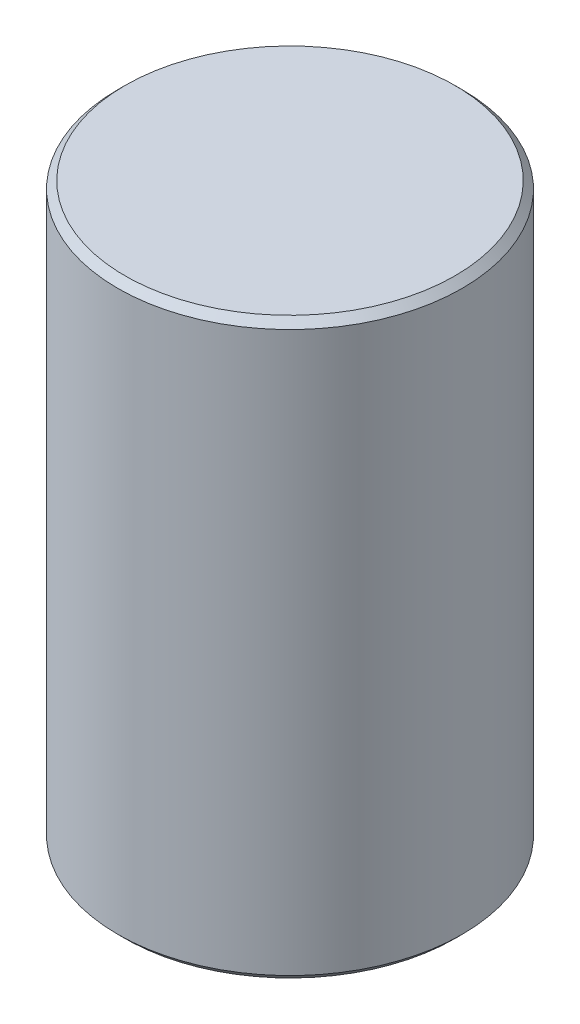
ISO-10303-21;
HEADER;
FILE_DESCRIPTION(('STEP AP214'),'2;1');
FILE_NAME('part.step','',(''),(''),'','','');
FILE_SCHEMA(('AUTOMOTIVE_DESIGN { 1 0 10303 214 1 1 1 1 }'));
ENDSEC;
DATA;
#1=APPLICATION_CONTEXT('core data for automotive mechanical design processes');
#2=APPLICATION_PROTOCOL_DEFINITION('international standard','automotive_design',2000,#1);
#3=PRODUCT_CONTEXT('',#1,'mechanical');
#4=PRODUCT('Part','Part','',(#3));
#5=PRODUCT_RELATED_PRODUCT_CATEGORY('part','',(#4));
#6=PRODUCT_DEFINITION_FORMATION('','',#4);
#7=PRODUCT_DEFINITION_CONTEXT('part definition',#1,'design');
#8=PRODUCT_DEFINITION('design','',#6,#7);
#9=PRODUCT_DEFINITION_SHAPE('','',#8);
#10=(LENGTH_UNIT() NAMED_UNIT(*) SI_UNIT(.MILLI.,.METRE.));
#11=(NAMED_UNIT(*) PLANE_ANGLE_UNIT() SI_UNIT($,.RADIAN.));
#12=(NAMED_UNIT(*) SI_UNIT($,.STERADIAN.) SOLID_ANGLE_UNIT());
#13=UNCERTAINTY_MEASURE_WITH_UNIT(LENGTH_MEASURE(1.E-05),#10,'distance_accuracy_value','');
#14=(GEOMETRIC_REPRESENTATION_CONTEXT(3) GLOBAL_UNCERTAINTY_ASSIGNED_CONTEXT((#13)) GLOBAL_UNIT_ASSIGNED_CONTEXT((#10,
#11,#12)) REPRESENTATION_CONTEXT('',''));
#15=CARTESIAN_POINT('',(0.,0.,0.));
#16=DIRECTION('',(0.,0.,1.));
#17=DIRECTION('',(1.,0.,0.));
#18=AXIS2_PLACEMENT_3D('',#15,#16,#17);
#19=CARTESIAN_POINT('',(0.,127.,0.));
#20=DIRECTION('',(0.,-1.,0.));
#21=DIRECTION('',(1.,0.,0.));
#22=AXIS2_PLACEMENT_3D('',#19,#20,#21);
#23=PLANE('',#22);
#24=CARTESIAN_POINT('',(0.,127.,0.));
#25=DIRECTION('',(0.,-1.,0.));
#26=DIRECTION('',(1.,0.,0.));
#27=AXIS2_PLACEMENT_3D('',#24,#25,#26);
#28=CIRCLE('',#27,36.4998);
#29=CARTESIAN_POINT('',(36.4998,127.,0.));
#30=VERTEX_POINT('',#29);
#31=EDGE_CURVE('E11',#30,#30,#28,.F.);
#32=ORIENTED_EDGE('',*,*,#31,.T.);
#33=EDGE_LOOP('',(#32));
#34=FACE_BOUND('',#33,.T.);
#35=ADVANCED_FACE('F36',(#34),#23,.F.);
#36=CARTESIAN_POINT('',(0.,127.,0.));
#37=DIRECTION('',(0.,1.,0.));
#38=DIRECTION('',(-1.,0.,0.));
#39=AXIS2_PLACEMENT_3D('',#36,#37,#38);
#40=CYLINDRICAL_SURFACE('',#39,38.1);
#41=CARTESIAN_POINT('',(0.,1.6002,0.));
#42=DIRECTION('',(0.,1.,0.));
#43=DIRECTION('',(-1.,0.,0.));
#44=AXIS2_PLACEMENT_3D('',#41,#42,#43);
#45=CIRCLE('',#44,38.1);
#46=CARTESIAN_POINT('',(-38.1,1.6002,0.));
#47=VERTEX_POINT('',#46);
#48=EDGE_CURVE('E59',#47,#47,#45,.T.);
#49=ORIENTED_EDGE('',*,*,#48,.T.);
#50=EDGE_LOOP('',(#49));
#51=FACE_BOUND('',#50,.T.);
#52=CARTESIAN_POINT('',(0.,125.3998,0.));
#53=DIRECTION('',(0.,-1.,0.));
#54=DIRECTION('',(1.,0.,0.));
#55=AXIS2_PLACEMENT_3D('',#52,#53,#54);
#56=CIRCLE('',#55,38.1);
#57=CARTESIAN_POINT('',(38.1,125.3998,0.));
#58=VERTEX_POINT('',#57);
#59=EDGE_CURVE('E55',#58,#58,#56,.T.);
#60=ORIENTED_EDGE('',*,*,#59,.T.);
#61=EDGE_LOOP('',(#60));
#62=FACE_BOUND('',#61,.T.);
#63=ADVANCED_FACE('F75',(#51,#62),#40,.T.);
#64=CARTESIAN_POINT('',(0.,0.,0.));
#65=DIRECTION('',(0.,1.,0.));
#66=DIRECTION('',(-1.,0.,0.));
#67=AXIS2_PLACEMENT_3D('',#64,#65,#66);
#68=PLANE('',#67);
#69=CARTESIAN_POINT('',(0.,0.,0.));
#70=DIRECTION('',(0.,-1.,0.));
#71=DIRECTION('',(0.,0.,-1.));
#72=AXIS2_PLACEMENT_3D('',#69,#70,#71);
#73=CIRCLE('',#72,6.74624);
#74=CARTESIAN_POINT('',(0.,0.,-6.74624));
#75=VERTEX_POINT('',#74);
#76=EDGE_CURVE('E56',#75,#75,#73,.T.);
#77=ORIENTED_EDGE('',*,*,#76,.F.);
#78=EDGE_LOOP('',(#77));
#79=FACE_BOUND('',#78,.T.);
#80=CARTESIAN_POINT('',(0.,0.,0.));
#81=DIRECTION('',(0.,1.,0.));
#82=DIRECTION('',(-1.,0.,0.));
#83=AXIS2_PLACEMENT_3D('',#80,#81,#82);
#84=CIRCLE('',#83,36.4998);
#85=CARTESIAN_POINT('',(-36.4998,0.,0.));
#86=VERTEX_POINT('',#85);
#87=EDGE_CURVE('E43',#86,#86,#84,.F.);
#88=ORIENTED_EDGE('',*,*,#87,.T.);
#89=EDGE_LOOP('',(#88));
#90=FACE_BOUND('',#89,.T.);
#91=ADVANCED_FACE('F68',(#79,#90),#68,.F.);
#92=CARTESIAN_POINT('',(0.,1.6002,0.));
#93=DIRECTION('',(0.,1.,0.));
#94=DIRECTION('',(-1.,0.,0.));
#95=AXIS2_PLACEMENT_3D('',#92,#93,#94);
#96=CONICAL_SURFACE('',#95,38.1,0.785398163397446);
#97=CARTESIAN_POINT('',(-36.4998,0.,0.));
#98=CARTESIAN_POINT('',(-36.51646875,0.0166687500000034,0.));
#99=CARTESIAN_POINT('',(-36.5331375,0.0333375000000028,0.));
#100=CARTESIAN_POINT('',(-36.566475,0.0666750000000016,0.));
#101=CARTESIAN_POINT('',(-36.58314375,0.083343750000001,0.));
#102=CARTESIAN_POINT('',(-36.61648125,0.116681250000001,0.));
#103=CARTESIAN_POINT('',(-36.63315,0.133350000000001,0.));
#104=CARTESIAN_POINT('',(-36.6664875,0.166687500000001,0.));
#105=CARTESIAN_POINT('',(-36.68315625,0.183356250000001,0.));
#106=CARTESIAN_POINT('',(-36.71649375,0.216693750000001,0.));
#107=CARTESIAN_POINT('',(-36.7331625,0.233362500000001,0.));
#108=CARTESIAN_POINT('',(-36.7665,0.266700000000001,0.));
#109=CARTESIAN_POINT('',(-36.78316875,0.283368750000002,0.));
#110=CARTESIAN_POINT('',(-36.81650625,0.316706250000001,0.));
#111=CARTESIAN_POINT('',(-36.833175,0.333375,0.));
#112=CARTESIAN_POINT('',(-36.8665125,0.3667125,0.));
#113=CARTESIAN_POINT('',(-36.88318125,0.383381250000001,0.));
#114=CARTESIAN_POINT('',(-36.91651875,0.416718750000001,0.));
#115=CARTESIAN_POINT('',(-36.9331875,0.433387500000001,0.));
#116=CARTESIAN_POINT('',(-36.966525,0.466725,0.));
#117=CARTESIAN_POINT('',(-36.98319375,0.48339375,0.));
#118=CARTESIAN_POINT('',(-37.01653125,0.516731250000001,0.));
#119=CARTESIAN_POINT('',(-37.0332,0.533400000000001,0.));
#120=CARTESIAN_POINT('',(-37.0665375,0.566737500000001,0.));
#121=CARTESIAN_POINT('',(-37.08320625,0.58340625,0.));
#122=CARTESIAN_POINT('',(-37.11654375,0.616743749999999,0.));
#123=CARTESIAN_POINT('',(-37.1332125,0.6334125,0.));
#124=CARTESIAN_POINT('',(-37.16655,0.66675,0.));
#125=CARTESIAN_POINT('',(-37.18321875,0.68341875,0.));
#126=CARTESIAN_POINT('',(-37.21655625,0.71675625,0.));
#127=CARTESIAN_POINT('',(-37.233225,0.733425,0.));
#128=CARTESIAN_POINT('',(-37.2665625,0.7667625,0.));
#129=CARTESIAN_POINT('',(-37.28323125,0.783431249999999,0.));
#130=CARTESIAN_POINT('',(-37.31656875,0.816768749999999,0.));
#131=CARTESIAN_POINT('',(-37.3332375,0.833437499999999,0.));
#132=CARTESIAN_POINT('',(-37.366575,0.866775,0.));
#133=CARTESIAN_POINT('',(-37.38324375,0.883443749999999,0.));
#134=CARTESIAN_POINT('',(-37.41658125,0.916781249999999,0.));
#135=CARTESIAN_POINT('',(-37.43325,0.933449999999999,0.));
#136=CARTESIAN_POINT('',(-37.4665875,0.966787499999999,0.));
#137=CARTESIAN_POINT('',(-37.48325625,0.98345625,0.));
#138=CARTESIAN_POINT('',(-37.51659375,1.01679375,0.));
#139=CARTESIAN_POINT('',(-37.5332625,1.0334625,0.));
#140=CARTESIAN_POINT('',(-37.5666,1.0668,0.));
#141=CARTESIAN_POINT('',(-37.58326875,1.08346875,0.));
#142=CARTESIAN_POINT('',(-37.61660625,1.11680625,0.));
#143=CARTESIAN_POINT('',(-37.633275,1.133475,0.));
#144=CARTESIAN_POINT('',(-37.6666125,1.1668125,0.));
#145=CARTESIAN_POINT('',(-37.68328125,1.18348125,0.));
#146=CARTESIAN_POINT('',(-37.71661875,1.21681875,0.));
#147=CARTESIAN_POINT('',(-37.7332875,1.2334875,0.));
#148=CARTESIAN_POINT('',(-37.766625,1.266825,0.));
#149=CARTESIAN_POINT('',(-37.78329375,1.28349375,0.));
#150=CARTESIAN_POINT('',(-37.81663125,1.31683125,0.));
#151=CARTESIAN_POINT('',(-37.8333,1.3335,0.));
#152=CARTESIAN_POINT('',(-37.8666375,1.3668375,0.));
#153=CARTESIAN_POINT('',(-37.88330625,1.38350625,0.));
#154=CARTESIAN_POINT('',(-37.91664375,1.41684375,0.));
#155=CARTESIAN_POINT('',(-37.9333125,1.4335125,0.));
#156=CARTESIAN_POINT('',(-37.96665,1.46685,0.));
#157=CARTESIAN_POINT('',(-37.98331875,1.48351875,0.));
#158=CARTESIAN_POINT('',(-38.01665625,1.51685625,0.));
#159=CARTESIAN_POINT('',(-38.033325,1.533525,0.));
#160=CARTESIAN_POINT('',(-38.0666625,1.5668625,0.));
#161=CARTESIAN_POINT('',(-38.08333125,1.58353125,0.));
#162=CARTESIAN_POINT('',(-38.1,1.6002,0.));
#163=B_SPLINE_CURVE_WITH_KNOTS('',3,(#97,#98,#99,#100,#101,#102,#103,#104,#105,#106,#107,#108,
#109,#110,#111,#112,#113,#114,#115,#116,#117,#118,#119,#120,#121,#122,#123,#124,#125,#126,#127,
#128,#129,#130,#131,#132,#133,#134,#135,#136,#137,#138,#139,#140,#141,#142,#143,#144,#145,#146,
#147,#148,#149,#150,#151,#152,#153,#154,#155,#156,#157,#158,#159,#160,#161,#162),.UNSPECIFIED.,
.F.,.F.,(4,2,2,2,2,2,2,2,2,2,2,2,2,2,2,2,2,2,2,2,2,2,2,2,2,2,2,2,2,2,2,2,4),(0.,
0.0707195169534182,0.141439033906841,0.212158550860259,0.282878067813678,0.353597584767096,
0.424317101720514,0.495036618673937,0.565756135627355,0.636475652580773,0.707195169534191,
0.77791468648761,0.848634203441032,0.919353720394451,0.990073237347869,1.06079275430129,
1.13151227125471,1.20223178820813,1.27295130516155,1.34367082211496,1.41439033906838,
1.48510985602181,1.55582937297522,1.62654888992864,1.69726840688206,1.76798792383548,
1.8387074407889,1.90942695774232,1.98014647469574,2.05086599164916,2.12158550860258,
2.192305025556,2.26302454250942),.UNSPECIFIED.);
#164=EDGE_CURVE('BSEAM70',#86,#47,#163,.T.);
#165=ORIENTED_EDGE('',*,*,#87,.F.);
#166=ORIENTED_EDGE('',*,*,#48,.F.);
#167=ORIENTED_EDGE('',*,*,#164,.T.);
#168=ORIENTED_EDGE('',*,*,#164,.F.);
#169=EDGE_LOOP('',(#165,#167,#166,#168));
#170=FACE_BOUND('',#169,.T.);
#171=ADVANCED_FACE('F70',(#170),#96,.T.);
#172=CARTESIAN_POINT('',(0.,127.,0.));
#173=DIRECTION('',(0.,-1.,0.));
#174=DIRECTION('',(1.,0.,0.));
#175=AXIS2_PLACEMENT_3D('',#172,#173,#174);
#176=CONICAL_SURFACE('',#175,36.4998,0.785398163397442);
#177=ORIENTED_EDGE('',*,*,#59,.F.);
#178=EDGE_LOOP('',(#177));
#179=FACE_BOUND('',#178,.T.);
#180=ORIENTED_EDGE('',*,*,#31,.F.);
#181=EDGE_LOOP('',(#180));
#182=FACE_BOUND('',#181,.T.);
#183=ADVANCED_FACE('F38',(#179,#182),#176,.T.);
#184=CARTESIAN_POINT('',(0.,38.6842,0.));
#185=DIRECTION('',(0.,-1.,0.));
#186=DIRECTION('',(0.,0.,-1.));
#187=AXIS2_PLACEMENT_3D('',#184,#185,#186);
#188=CONICAL_SURFACE('',#187,6.74623999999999,1.02974425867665);
#189=CARTESIAN_POINT('',(0.,42.7377499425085,0.));
#190=VERTEX_POINT('',#189);
#191=VERTEX_LOOP('',#190);
#192=FACE_BOUND('',#191,.T.);
#193=CARTESIAN_POINT('',(0.,38.6842,0.));
#194=DIRECTION('',(0.,-1.,0.));
#195=DIRECTION('',(0.,0.,-1.));
#196=AXIS2_PLACEMENT_3D('',#193,#194,#195);
#197=CIRCLE('',#196,6.74623999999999);
#198=CARTESIAN_POINT('',(0.,38.6842,-6.74623999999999));
#199=VERTEX_POINT('',#198);
#200=EDGE_CURVE('E53',#199,#199,#197,.T.);
#201=ORIENTED_EDGE('',*,*,#200,.T.);
#202=EDGE_LOOP('',(#201));
#203=FACE_BOUND('',#202,.T.);
#204=ADVANCED_FACE('F46',(#192,#203),#188,.F.);
#205=CARTESIAN_POINT('',(0.,0.,0.));
#206=DIRECTION('',(0.,-1.,0.));
#207=DIRECTION('',(0.,0.,-1.));
#208=AXIS2_PLACEMENT_3D('',#205,#206,#207);
#209=CYLINDRICAL_SURFACE('',#208,6.74624);
#210=ORIENTED_EDGE('',*,*,#200,.F.);
#211=EDGE_LOOP('',(#210));
#212=FACE_BOUND('',#211,.T.);
#213=ORIENTED_EDGE('',*,*,#76,.T.);
#214=EDGE_LOOP('',(#213));
#215=FACE_BOUND('',#214,.T.);
#216=ADVANCED_FACE('F49',(#212,#215),#209,.F.);
#217=CLOSED_SHELL('',(#35,#63,#91,#171,#183,#204,#216));
#218=MANIFOLD_SOLID_BREP('B2',#217);
#219=ADVANCED_BREP_SHAPE_REPRESENTATION('',(#18,#218),#14);
#220=SHAPE_DEFINITION_REPRESENTATION(#9,#219);
ENDSEC;
END-ISO-10303-21;
